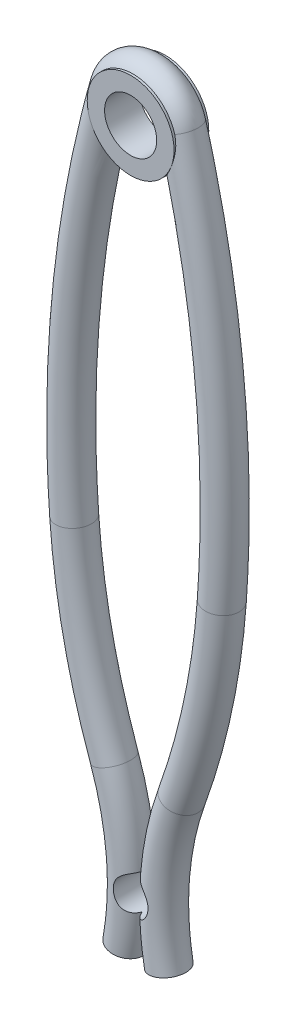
from build123d import *

# Parameters (mm, degrees)
SKETCH5_R               = 1.27
CUT_EXTRUDE1_DEPTH      = 36.681746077
CUT_EXTRUDE1_DEPTH_BACK = 36.681746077
SKETCH6_R               = 1.27
SKETCH7_R               = 3.175
EXTRUDE1_DEPTH          = 1.27
SKETCH8_R               = 1.905
CUT_EXTRUDE2_DEPTH      = 36.749485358


with BuildPart() as part:
    # Sweep1: sweep along a path in Sketch4
    with BuildLine(Plane.XY) as sweep1_path:
        ThreePointArc((1.524, -21.932836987), (1.258560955, -16.26346617), (2.466131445, -10.717837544))
        ThreePointArc((2.466131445, -10.717837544), (4.407009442, -3.88086265), (5.397406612, 3.156917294))
        ThreePointArc((5.397406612, 3.156917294), (5.172161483, 17.643381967), (2.443577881, 31.87233926))
        ThreePointArc((2.443577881, 31.87233926), (1.531481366, 33.205506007), (0, 33.719138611))
    # Sketch5 → Sweep1 (sweep)
    with BuildSketch(Plane(origin=(0, 0, 0), x_dir=(0, 0, -1), z_dir=(1, 0, 0))):
        with Locations((0, 33.719138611)):
            Circle(SKETCH5_R)
    sweep1 = sweep(path=sweep1_path.line)

    # Mirror1: Sweep1 across plane
    add(sweep1.mirror(Plane(origin=(0, 0, 0), x_dir=(0, 0, 1), z_dir=(1, 0, 0))))

    # Sketch6 → Cut-Extrude1 (cut, two sides: drawn at the far end of the back side and taken through both)
    with BuildSketch(Plane.XY.offset(-CUT_EXTRUDE1_DEPTH_BACK)):
        with Locations(Location((0, -17.78, 0), (0, 0, 19.842505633))):
            Circle(SKETCH6_R)
    extrude(amount=CUT_EXTRUDE1_DEPTH + CUT_EXTRUDE1_DEPTH_BACK, mode=Mode.SUBTRACT)

    # Sketch7 → Extrude1 (add, symmetric)
    with BuildSketch(Plane.XY):
        with Locations((0, 31.179138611)):
            Circle(SKETCH7_R)
    extrude(amount=EXTRUDE1_DEPTH, both=True)

    # Sketch8 → Cut-Extrude2 (cut, through all)
    with BuildSketch(Plane.XY.offset(1.27)):
        with Locations((0, 31.179138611)):
            Circle(SKETCH8_R)
    extrude(amount=-CUT_EXTRUDE2_DEPTH, mode=Mode.SUBTRACT)


solid = part.part
